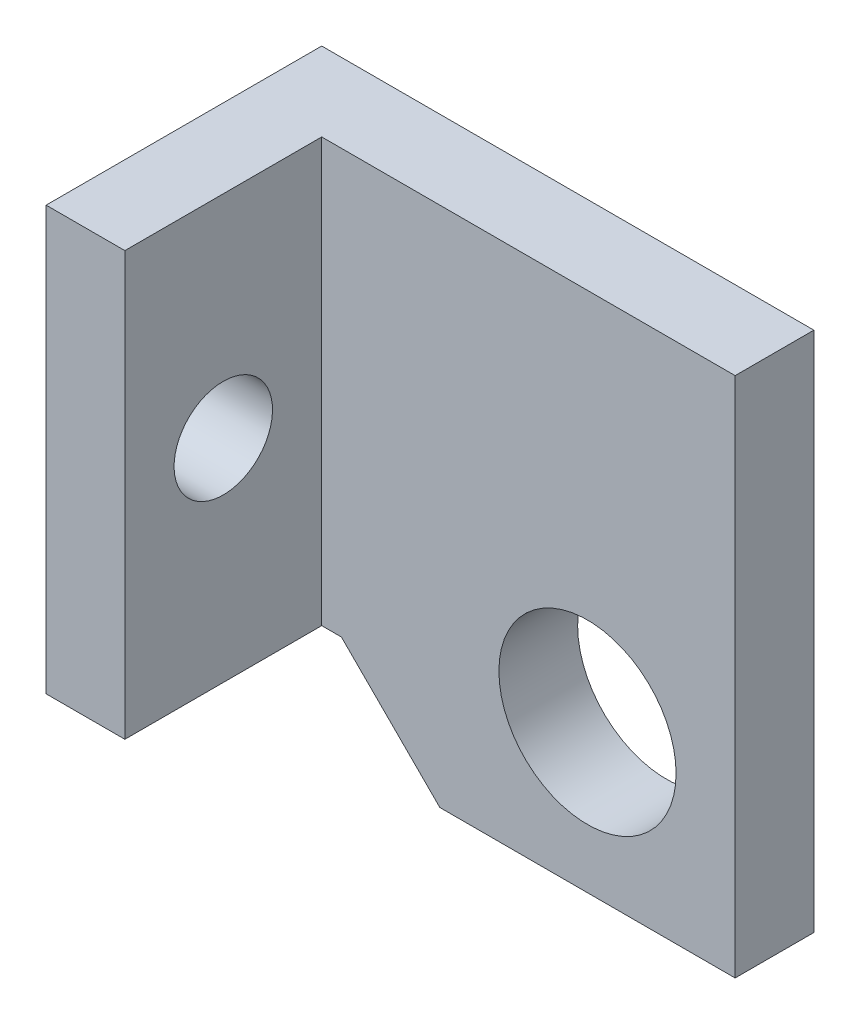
from build123d import *

# Parameters (mm, degrees)
ESQUISSE1_R             = 9
EXTRUSION1_DEPTH        = 8
ESQUISSE2_W             = 8
ESQUISSE2_H             = 43
EXTRUSION2_DEPTH        = 20
ENL_V_MAT_EXTRU_1_REACH = 65.182
ESQUISSE3_R             = 5


with BuildPart() as part:
    # Esquisse1 → Extrusion1 (new body)
    with BuildSketch(Plane.XY):
        Polygon((-35, 38), (-35, -5), (-25, -5), (-15, -15), (15, -15), (15, 38), align=None)
        Circle(ESQUISSE1_R, mode=Mode.SUBTRACT)
    extrude(amount=EXTRUSION1_DEPTH)

    # Esquisse2 → Extrusion2 (add)
    with BuildSketch(Plane.XY.offset(8)):
        with Locations((-31, 16.5)):
            Rectangle(ESQUISSE2_W, ESQUISSE2_H)
    extrude(amount=EXTRUSION2_DEPTH)

    # Esquisse3 → Enl_v. mat.-Extru.1 (cut, up to next)
    with BuildSketch(Plane(origin=(-27, 0, 0), x_dir=(0, 0, -1), z_dir=(1, 0, 0)), mode=Mode.PRIVATE) as enl_v_mat_extru_1_sk1:
        with Locations(Location((-18, 16.5, 0), (0, 0, 90))):
            Circle(ESQUISSE3_R)
    enl_v_mat_extru_1_tool1 = extrude(enl_v_mat_extru_1_sk1.sketch, amount=-ENL_V_MAT_EXTRU_1_REACH, mode=Mode.PRIVATE) & part.part
    add(enl_v_mat_extru_1_tool1.solids().sort_by_distance((-27, 16.5, 18))[0], mode=Mode.SUBTRACT)


solid = part.part
